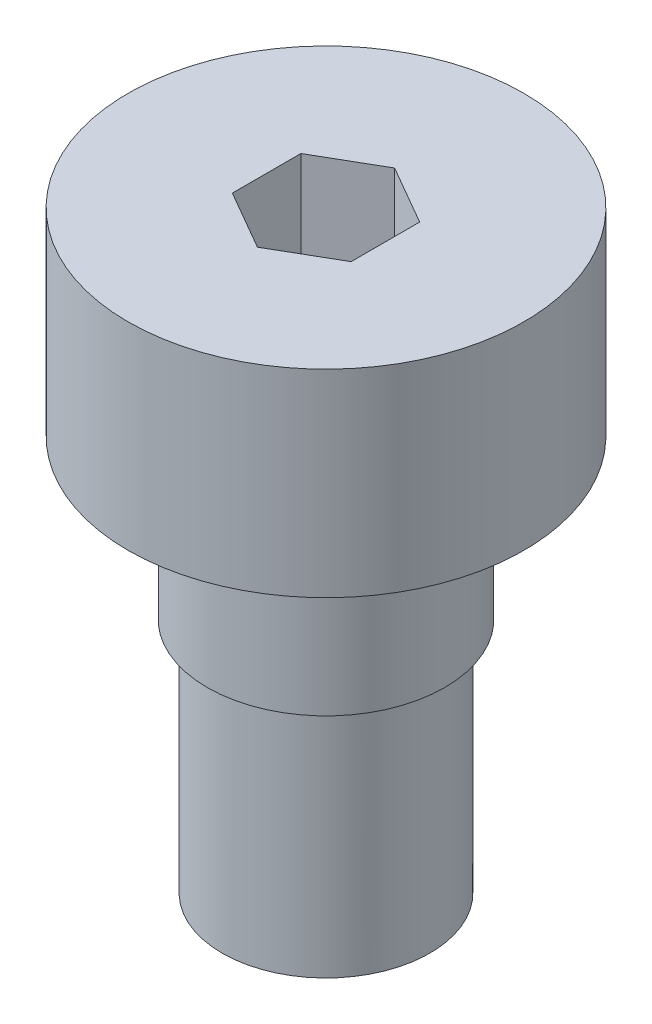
ISO-10303-21;
HEADER;
FILE_DESCRIPTION(('STEP AP214'),'2;1');
FILE_NAME('part.step','',(''),(''),'','','');
FILE_SCHEMA(('AUTOMOTIVE_DESIGN { 1 0 10303 214 1 1 1 1 }'));
ENDSEC;
DATA;
#1=APPLICATION_CONTEXT('core data for automotive mechanical design processes');
#2=APPLICATION_PROTOCOL_DEFINITION('international standard','automotive_design',2000,#1);
#3=PRODUCT_CONTEXT('',#1,'mechanical');
#4=PRODUCT('Part','Part','',(#3));
#5=PRODUCT_RELATED_PRODUCT_CATEGORY('part','',(#4));
#6=PRODUCT_DEFINITION_FORMATION('','',#4);
#7=PRODUCT_DEFINITION_CONTEXT('part definition',#1,'design');
#8=PRODUCT_DEFINITION('design','',#6,#7);
#9=PRODUCT_DEFINITION_SHAPE('','',#8);
#10=(LENGTH_UNIT() NAMED_UNIT(*) SI_UNIT(.MILLI.,.METRE.));
#11=(NAMED_UNIT(*) PLANE_ANGLE_UNIT() SI_UNIT($,.RADIAN.));
#12=(NAMED_UNIT(*) SI_UNIT($,.STERADIAN.) SOLID_ANGLE_UNIT());
#13=UNCERTAINTY_MEASURE_WITH_UNIT(LENGTH_MEASURE(1.E-05),#10,'distance_accuracy_value','');
#14=(GEOMETRIC_REPRESENTATION_CONTEXT(3) GLOBAL_UNCERTAINTY_ASSIGNED_CONTEXT((#13)) GLOBAL_UNIT_ASSIGNED_CONTEXT((#10,
#11,#12)) REPRESENTATION_CONTEXT('',''));
#15=CARTESIAN_POINT('',(0.,0.,0.));
#16=DIRECTION('',(0.,0.,1.));
#17=DIRECTION('',(1.,0.,0.));
#18=AXIS2_PLACEMENT_3D('',#15,#16,#17);
#19=CARTESIAN_POINT('',(1.77635683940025E-12,-3.17499999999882,2.66453525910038E-12));
#20=DIRECTION('',(0.,1.,0.));
#21=DIRECTION('',(0.,0.,1.00000000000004));
#22=AXIS2_PLACEMENT_3D('',#19,#20,#21);
#23=PLANE('',#22);
#24=CARTESIAN_POINT('',(1.77635683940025E-12,-3.17499999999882,2.66453525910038E-12));
#25=DIRECTION('',(0.,1.,0.));
#26=DIRECTION('',(0.,0.,1.00000000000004));
#27=AXIS2_PLACEMENT_3D('',#24,#25,#26);
#28=CIRCLE('',#27,2.38125);
#29=CARTESIAN_POINT('',(1.77364702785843E-12,-3.17499999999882,2.38125000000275));
#30=VERTEX_POINT('',#29);
#31=EDGE_CURVE('E149',#30,#30,#28,.T.);
#32=ORIENTED_EDGE('',*,*,#31,.F.);
#33=EDGE_LOOP('',(#32));
#34=FACE_BOUND('',#33,.T.);
#35=CARTESIAN_POINT('',(1.77635683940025E-12,-3.17499999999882,2.66453525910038E-12));
#36=DIRECTION('',(0.,1.,0.));
#37=DIRECTION('',(0.,0.,1.00000000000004));
#38=AXIS2_PLACEMENT_3D('',#35,#36,#37);
#39=CIRCLE('',#38,2.0828);
#40=CARTESIAN_POINT('',(1.77398665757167E-12,-3.17499999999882,2.08280000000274));
#41=VERTEX_POINT('',#40);
#42=EDGE_CURVE('E11',#41,#41,#39,.F.);
#43=ORIENTED_EDGE('',*,*,#42,.F.);
#44=EDGE_LOOP('',(#43));
#45=FACE_BOUND('',#44,.T.);
#46=ADVANCED_FACE('F38',(#34,#45),#23,.F.);
#47=CARTESIAN_POINT('',(0.,3.96874999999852,1.77635683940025E-12));
#48=DIRECTION('',(0.,-1.,0.));
#49=DIRECTION('',(0.,0.,-1.00000000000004));
#50=AXIS2_PLACEMENT_3D('',#47,#48,#49);
#51=CYLINDRICAL_SURFACE('',#50,3.96875);
#52=CARTESIAN_POINT('',(0.,3.96874999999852,1.77635683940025E-12));
#53=DIRECTION('',(0.,1.,0.));
#54=DIRECTION('',(0.,0.,1.00000000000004));
#55=AXIS2_PLACEMENT_3D('',#52,#53,#54);
#56=CIRCLE('',#55,3.96875);
#57=CARTESIAN_POINT('',(0.,3.96874999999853,3.96875000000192));
#58=VERTEX_POINT('',#57);
#59=EDGE_CURVE('E46',#58,#58,#56,.T.);
#60=ORIENTED_EDGE('',*,*,#59,.F.);
#61=EDGE_LOOP('',(#60));
#62=FACE_BOUND('',#61,.T.);
#63=CARTESIAN_POINT('',(0.,0.,0.));
#64=DIRECTION('',(0.,1.,0.));
#65=DIRECTION('',(0.,0.,1.00000000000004));
#66=AXIS2_PLACEMENT_3D('',#63,#64,#65);
#67=CIRCLE('',#66,3.96875);
#68=CARTESIAN_POINT('',(0.,0.,3.96875000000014));
#69=VERTEX_POINT('',#68);
#70=EDGE_CURVE('E152',#69,#69,#67,.T.);
#71=ORIENTED_EDGE('',*,*,#70,.T.);
#72=EDGE_LOOP('',(#71));
#73=FACE_BOUND('',#72,.T.);
#74=ADVANCED_FACE('F40',(#62,#73),#51,.T.);
#75=CARTESIAN_POINT('',(0.,3.96874999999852,1.77635683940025E-12));
#76=DIRECTION('',(0.,1.,0.));
#77=DIRECTION('',(0.,0.,1.00000000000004));
#78=AXIS2_PLACEMENT_3D('',#75,#76,#77);
#79=PLANE('',#78);
#80=DIRECTION('',(-0.866025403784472,0.,-0.500000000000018));
#81=VECTOR('',#80,1.);
#82=CARTESIAN_POINT('',(1.19062499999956,3.96875000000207,-0.687407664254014));
#83=LINE('',#82,#81);
#84=CARTESIAN_POINT('',(1.19062499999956,3.96875000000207,-0.687407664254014));
#85=VERTEX_POINT('',#84);
#86=CARTESIAN_POINT('',(1.77635683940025E-12,3.96874999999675,-1.37481532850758));
#87=VERTEX_POINT('',#86);
#88=EDGE_CURVE('E53',#85,#87,#83,.T.);
#89=ORIENTED_EDGE('',*,*,#88,.F.);
#90=DIRECTION('',(0.,0.,-1.00000000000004));
#91=VECTOR('',#90,1.);
#92=CARTESIAN_POINT('',(1.19062500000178,3.9687500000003,0.687407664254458));
#93=LINE('',#92,#91);
#94=CARTESIAN_POINT('',(1.19062500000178,3.9687500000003,0.687407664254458));
#95=VERTEX_POINT('',#94);
#96=EDGE_CURVE('E136',#95,#85,#93,.T.);
#97=ORIENTED_EDGE('',*,*,#96,.F.);
#98=DIRECTION('',(0.866025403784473,0.,-0.500000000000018));
#99=VECTOR('',#98,1.);
#100=CARTESIAN_POINT('',(4.44089209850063E-13,3.9687500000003,1.37481532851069));
#101=LINE('',#100,#99);
#102=CARTESIAN_POINT('',(4.44089209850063E-13,3.9687500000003,1.37481532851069));
#103=VERTEX_POINT('',#102);
#104=EDGE_CURVE('E134',#103,#95,#101,.T.);
#105=ORIENTED_EDGE('',*,*,#104,.F.);
#106=DIRECTION('',(0.866025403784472,0.,0.500000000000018));
#107=VECTOR('',#106,1.);
#108=CARTESIAN_POINT('',(-1.19062499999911,3.96874999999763,0.687407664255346));
#109=LINE('',#108,#107);
#110=CARTESIAN_POINT('',(-1.19062499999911,3.96874999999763,0.687407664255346));
#111=VERTEX_POINT('',#110);
#112=EDGE_CURVE('E101',#111,#103,#109,.T.);
#113=ORIENTED_EDGE('',*,*,#112,.F.);
#114=DIRECTION('',(0.,0.,1.00000000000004));
#115=VECTOR('',#114,1.);
#116=CARTESIAN_POINT('',(-1.19062499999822,3.96875000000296,-0.68740766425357));
#117=LINE('',#116,#115);
#118=CARTESIAN_POINT('',(-1.19062499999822,3.96875000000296,-0.68740766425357));
#119=VERTEX_POINT('',#118);
#120=EDGE_CURVE('E130',#119,#111,#117,.T.);
#121=ORIENTED_EDGE('',*,*,#120,.F.);
#122=DIRECTION('',(-0.866025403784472,0.,0.500000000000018));
#123=VECTOR('',#122,1.);
#124=CARTESIAN_POINT('',(1.77635683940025E-12,3.96874999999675,-1.37481532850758));
#125=LINE('',#124,#123);
#126=EDGE_CURVE('E127',#87,#119,#125,.T.);
#127=ORIENTED_EDGE('',*,*,#126,.F.);
#128=EDGE_LOOP('',(#89,#97,#105,#113,#121,#127));
#129=FACE_BOUND('',#128,.T.);
#130=ORIENTED_EDGE('',*,*,#59,.T.);
#131=EDGE_LOOP('',(#130));
#132=FACE_BOUND('',#131,.T.);
#133=ADVANCED_FACE('F163',(#129,#132),#79,.T.);
#134=CARTESIAN_POINT('',(0.,0.,0.));
#135=DIRECTION('',(0.,1.,0.));
#136=DIRECTION('',(0.,0.,1.00000000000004));
#137=AXIS2_PLACEMENT_3D('',#134,#135,#136);
#138=PLANE('',#137);
#139=CARTESIAN_POINT('',(0.,0.,0.));
#140=DIRECTION('',(0.,1.,0.));
#141=DIRECTION('',(0.,0.,1.00000000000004));
#142=AXIS2_PLACEMENT_3D('',#139,#140,#141);
#143=CIRCLE('',#142,2.38125);
#144=CARTESIAN_POINT('',(0.,0.,2.38125000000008));
#145=VERTEX_POINT('',#144);
#146=EDGE_CURVE('E148',#145,#145,#143,.T.);
#147=ORIENTED_EDGE('',*,*,#146,.T.);
#148=EDGE_LOOP('',(#147));
#149=FACE_BOUND('',#148,.T.);
#150=ORIENTED_EDGE('',*,*,#70,.F.);
#151=EDGE_LOOP('',(#150));
#152=FACE_BOUND('',#151,.T.);
#153=ADVANCED_FACE('F160',(#149,#152),#138,.F.);
#154=CARTESIAN_POINT('',(1.77635683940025E-12,-3.17499999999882,2.66453525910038E-12));
#155=DIRECTION('',(0.,1.,0.));
#156=DIRECTION('',(0.,0.,1.00000000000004));
#157=AXIS2_PLACEMENT_3D('',#154,#155,#156);
#158=CYLINDRICAL_SURFACE('',#157,2.38125);
#159=ORIENTED_EDGE('',*,*,#31,.T.);
#160=EDGE_LOOP('',(#159));
#161=FACE_BOUND('',#160,.T.);
#162=ORIENTED_EDGE('',*,*,#146,.F.);
#163=EDGE_LOOP('',(#162));
#164=FACE_BOUND('',#163,.T.);
#165=ADVANCED_FACE('F162',(#161,#164),#158,.T.);
#166=CARTESIAN_POINT('',(-2.22044604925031E-12,-7.93750000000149,8.88178419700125E-13));
#167=DIRECTION('',(0.,1.,0.));
#168=DIRECTION('',(0.,0.,1.00000000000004));
#169=AXIS2_PLACEMENT_3D('',#166,#167,#168);
#170=CYLINDRICAL_SURFACE('',#169,2.0828);
#171=CARTESIAN_POINT('',(-2.22044604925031E-12,-7.93750000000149,8.88178419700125E-13));
#172=DIRECTION('',(0.,-1.,0.));
#173=DIRECTION('',(0.,0.,-1.00000000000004));
#174=AXIS2_PLACEMENT_3D('',#171,#172,#173);
#175=CIRCLE('',#174,2.0828);
#176=CARTESIAN_POINT('',(-2.21807586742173E-12,-7.93750000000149,-2.08279999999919));
#177=VERTEX_POINT('',#176);
#178=EDGE_CURVE('E140',#177,#177,#175,.T.);
#179=ORIENTED_EDGE('',*,*,#178,.F.);
#180=EDGE_LOOP('',(#179));
#181=FACE_BOUND('',#180,.T.);
#182=ORIENTED_EDGE('',*,*,#42,.T.);
#183=EDGE_LOOP('',(#182));
#184=FACE_BOUND('',#183,.T.);
#185=ADVANCED_FACE('F169',(#181,#184),#170,.T.);
#186=CARTESIAN_POINT('',(-2.22044604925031E-12,-7.93750000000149,8.88178419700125E-13));
#187=DIRECTION('',(0.,-1.,0.));
#188=DIRECTION('',(0.,0.,-1.00000000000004));
#189=AXIS2_PLACEMENT_3D('',#186,#187,#188);
#190=PLANE('',#189);
#191=ORIENTED_EDGE('',*,*,#178,.T.);
#192=EDGE_LOOP('',(#191));
#193=FACE_BOUND('',#192,.T.);
#194=ADVANCED_FACE('F186',(#193),#190,.T.);
#195=CARTESIAN_POINT('',(1.19062500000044,4.44089209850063E-12,-0.687407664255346));
#196=DIRECTION('',(0.500000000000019,0.,-0.866025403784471));
#197=DIRECTION('',(-0.866025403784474,0.,-0.500000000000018));
#198=AXIS2_PLACEMENT_3D('',#195,#196,#197);
#199=PLANE('',#198);
#200=ORIENTED_EDGE('',*,*,#88,.T.);
#201=DIRECTION('',(0.,1.,0.));
#202=VECTOR('',#201,1.);
#203=CARTESIAN_POINT('',(-4.44089209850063E-13,-8.88178419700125E-13,-1.37481532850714));
#204=LINE('',#203,#202);
#205=CARTESIAN_POINT('',(-4.44089209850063E-13,-8.88178419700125E-13,-1.37481532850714));
#206=VERTEX_POINT('',#205);
#207=EDGE_CURVE('E83',#206,#87,#204,.T.);
#208=ORIENTED_EDGE('',*,*,#207,.F.);
#209=DIRECTION('',(-0.866025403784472,0.,-0.500000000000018));
#210=VECTOR('',#209,1.);
#211=CARTESIAN_POINT('',(1.19062500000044,4.44089209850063E-12,-0.687407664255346));
#212=LINE('',#211,#210);
#213=CARTESIAN_POINT('',(1.19062500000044,4.44089209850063E-12,-0.687407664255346));
#214=VERTEX_POINT('',#213);
#215=EDGE_CURVE('E138',#214,#206,#212,.T.);
#216=ORIENTED_EDGE('',*,*,#215,.F.);
#217=DIRECTION('',(0.,1.,0.));
#218=VECTOR('',#217,1.);
#219=CARTESIAN_POINT('',(1.19062500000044,4.44089209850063E-12,-0.687407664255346));
#220=LINE('',#219,#218);
#221=EDGE_CURVE('E61',#214,#85,#220,.T.);
#222=ORIENTED_EDGE('',*,*,#221,.T.);
#223=EDGE_LOOP('',(#200,#208,#216,#222));
#224=FACE_BOUND('',#223,.T.);
#225=ADVANCED_FACE('F190',(#224),#199,.F.);
#226=CARTESIAN_POINT('',(1.190625,3.5527136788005E-12,0.687407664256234));
#227=DIRECTION('',(1.00000000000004,0.,0.));
#228=DIRECTION('',(0.,0.,-1.00000000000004));
#229=AXIS2_PLACEMENT_3D('',#226,#227,#228);
#230=PLANE('',#229);
#231=ORIENTED_EDGE('',*,*,#96,.T.);
#232=ORIENTED_EDGE('',*,*,#221,.F.);
#233=DIRECTION('',(0.,0.,-1.00000000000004));
#234=VECTOR('',#233,1.);
#235=CARTESIAN_POINT('',(1.190625,3.5527136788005E-12,0.687407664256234));
#236=LINE('',#235,#234);
#237=CARTESIAN_POINT('',(1.190625,3.5527136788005E-12,0.687407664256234));
#238=VERTEX_POINT('',#237);
#239=EDGE_CURVE('E113',#238,#214,#236,.T.);
#240=ORIENTED_EDGE('',*,*,#239,.F.);
#241=DIRECTION('',(0.,1.,0.));
#242=VECTOR('',#241,1.);
#243=CARTESIAN_POINT('',(1.190625,3.5527136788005E-12,0.687407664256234));
#244=LINE('',#243,#242);
#245=EDGE_CURVE('E105',#238,#95,#244,.T.);
#246=ORIENTED_EDGE('',*,*,#245,.T.);
#247=EDGE_LOOP('',(#231,#232,#240,#246));
#248=FACE_BOUND('',#247,.T.);
#249=ADVANCED_FACE('F194',(#248),#230,.F.);
#250=CARTESIAN_POINT('',(-1.77635683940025E-12,1.77635683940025E-12,1.37481532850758));
#251=DIRECTION('',(0.500000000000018,0.,0.86602540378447));
#252=DIRECTION('',(0.866025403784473,0.,-0.500000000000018));
#253=AXIS2_PLACEMENT_3D('',#250,#251,#252);
#254=PLANE('',#253);
#255=ORIENTED_EDGE('',*,*,#104,.T.);
#256=ORIENTED_EDGE('',*,*,#245,.F.);
#257=DIRECTION('',(0.866025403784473,0.,-0.500000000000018));
#258=VECTOR('',#257,1.);
#259=CARTESIAN_POINT('',(-1.77635683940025E-12,1.77635683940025E-12,1.37481532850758));
#260=LINE('',#259,#258);
#261=CARTESIAN_POINT('',(-1.77635683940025E-12,1.77635683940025E-12,1.37481532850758));
#262=VERTEX_POINT('',#261);
#263=EDGE_CURVE('E109',#262,#238,#260,.T.);
#264=ORIENTED_EDGE('',*,*,#263,.F.);
#265=DIRECTION('',(0.,1.,0.));
#266=VECTOR('',#265,1.);
#267=CARTESIAN_POINT('',(-1.77635683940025E-12,1.77635683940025E-12,1.37481532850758));
#268=LINE('',#267,#266);
#269=EDGE_CURVE('E94',#262,#103,#268,.T.);
#270=ORIENTED_EDGE('',*,*,#269,.T.);
#271=EDGE_LOOP('',(#255,#256,#264,#270));
#272=FACE_BOUND('',#271,.T.);
#273=ADVANCED_FACE('F110',(#272),#254,.F.);
#274=CARTESIAN_POINT('',(-1.19062499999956,2.66453525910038E-12,0.687407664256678));
#275=DIRECTION('',(-0.50000000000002,0.,0.86602540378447));
#276=DIRECTION('',(0.866025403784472,0.,0.500000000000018));
#277=AXIS2_PLACEMENT_3D('',#274,#275,#276);
#278=PLANE('',#277);
#279=ORIENTED_EDGE('',*,*,#112,.T.);
#280=ORIENTED_EDGE('',*,*,#269,.F.);
#281=DIRECTION('',(0.866025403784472,0.,0.500000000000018));
#282=VECTOR('',#281,1.);
#283=CARTESIAN_POINT('',(-1.19062499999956,2.66453525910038E-12,0.687407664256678));
#284=LINE('',#283,#282);
#285=CARTESIAN_POINT('',(-1.19062499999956,2.66453525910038E-12,0.687407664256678));
#286=VERTEX_POINT('',#285);
#287=EDGE_CURVE('E98',#286,#262,#284,.T.);
#288=ORIENTED_EDGE('',*,*,#287,.F.);
#289=DIRECTION('',(0.,1.,0.));
#290=VECTOR('',#289,1.);
#291=CARTESIAN_POINT('',(-1.19062499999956,2.66453525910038E-12,0.687407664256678));
#292=LINE('',#291,#290);
#293=EDGE_CURVE('E106',#286,#111,#292,.T.);
#294=ORIENTED_EDGE('',*,*,#293,.T.);
#295=EDGE_LOOP('',(#279,#280,#288,#294));
#296=FACE_BOUND('',#295,.T.);
#297=ADVANCED_FACE('F96',(#296),#278,.F.);
#298=CARTESIAN_POINT('',(-1.19062499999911,1.77635683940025E-12,-0.687407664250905));
#299=DIRECTION('',(-1.00000000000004,0.,0.));
#300=DIRECTION('',(0.,0.,1.00000000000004));
#301=AXIS2_PLACEMENT_3D('',#298,#299,#300);
#302=PLANE('',#301);
#303=ORIENTED_EDGE('',*,*,#120,.T.);
#304=ORIENTED_EDGE('',*,*,#293,.F.);
#305=DIRECTION('',(0.,0.,1.00000000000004));
#306=VECTOR('',#305,1.);
#307=CARTESIAN_POINT('',(-1.19062499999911,1.77635683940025E-12,-0.687407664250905));
#308=LINE('',#307,#306);
#309=CARTESIAN_POINT('',(-1.19062499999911,1.77635683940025E-12,-0.687407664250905));
#310=VERTEX_POINT('',#309);
#311=EDGE_CURVE('E119',#310,#286,#308,.T.);
#312=ORIENTED_EDGE('',*,*,#311,.F.);
#313=DIRECTION('',(0.,1.,0.));
#314=VECTOR('',#313,1.);
#315=CARTESIAN_POINT('',(-1.19062499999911,1.77635683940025E-12,-0.687407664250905));
#316=LINE('',#315,#314);
#317=EDGE_CURVE('E143',#310,#119,#316,.T.);
#318=ORIENTED_EDGE('',*,*,#317,.T.);
#319=EDGE_LOOP('',(#303,#304,#312,#318));
#320=FACE_BOUND('',#319,.T.);
#321=ADVANCED_FACE('F198',(#320),#302,.F.);
#322=CARTESIAN_POINT('',(-4.44089209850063E-13,-8.88178419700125E-13,-1.37481532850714));
#323=DIRECTION('',(-0.500000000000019,0.,-0.86602540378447));
#324=DIRECTION('',(-0.866025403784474,0.,0.500000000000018));
#325=AXIS2_PLACEMENT_3D('',#322,#323,#324);
#326=PLANE('',#325);
#327=ORIENTED_EDGE('',*,*,#126,.T.);
#328=ORIENTED_EDGE('',*,*,#317,.F.);
#329=DIRECTION('',(-0.866025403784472,0.,0.500000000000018));
#330=VECTOR('',#329,1.);
#331=CARTESIAN_POINT('',(-4.44089209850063E-13,-8.88178419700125E-13,-1.37481532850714));
#332=LINE('',#331,#330);
#333=EDGE_CURVE('E121',#206,#310,#332,.T.);
#334=ORIENTED_EDGE('',*,*,#333,.F.);
#335=ORIENTED_EDGE('',*,*,#207,.T.);
#336=EDGE_LOOP('',(#327,#328,#334,#335));
#337=FACE_BOUND('',#336,.T.);
#338=ADVANCED_FACE('F195',(#337),#326,.F.);
#339=CARTESIAN_POINT('',(-4.44089209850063E-13,-8.88178419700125E-13,-1.37481532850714));
#340=DIRECTION('',(0.,1.,0.));
#341=DIRECTION('',(0.,0.,1.00000000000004));
#342=AXIS2_PLACEMENT_3D('',#339,#340,#341);
#343=PLANE('',#342);
#344=ORIENTED_EDGE('',*,*,#215,.T.);
#345=ORIENTED_EDGE('',*,*,#333,.T.);
#346=ORIENTED_EDGE('',*,*,#311,.T.);
#347=ORIENTED_EDGE('',*,*,#287,.T.);
#348=ORIENTED_EDGE('',*,*,#263,.T.);
#349=ORIENTED_EDGE('',*,*,#239,.T.);
#350=EDGE_LOOP('',(#344,#345,#346,#347,#348,#349));
#351=FACE_BOUND('',#350,.T.);
#352=ADVANCED_FACE('F116',(#351),#343,.T.);
#353=CLOSED_SHELL('',(#46,#74,#133,#153,#165,#185,#194,#225,#249,#273,#297,#321,#338,#352));
#354=MANIFOLD_SOLID_BREP('B2',#353);
#355=ADVANCED_BREP_SHAPE_REPRESENTATION('',(#18,#354),#14);
#356=SHAPE_DEFINITION_REPRESENTATION(#9,#355);
ENDSEC;
END-ISO-10303-21;
